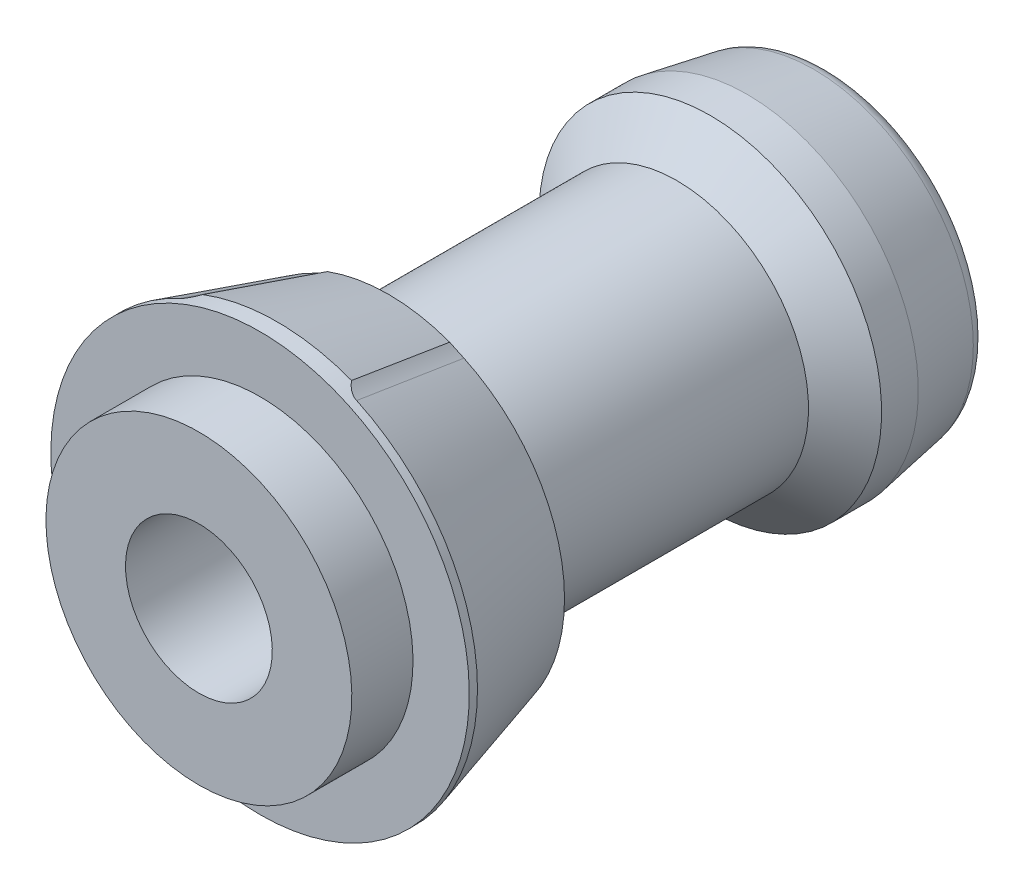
ISO-10303-21;
HEADER;
FILE_DESCRIPTION(('STEP AP214'),'2;1');
FILE_NAME('part.step','',(''),(''),'','','');
FILE_SCHEMA(('AUTOMOTIVE_DESIGN { 1 0 10303 214 1 1 1 1 }'));
ENDSEC;
DATA;
#1=APPLICATION_CONTEXT('core data for automotive mechanical design processes');
#2=APPLICATION_PROTOCOL_DEFINITION('international standard','automotive_design',2000,#1);
#3=PRODUCT_CONTEXT('',#1,'mechanical');
#4=PRODUCT('Part','Part','',(#3));
#5=PRODUCT_RELATED_PRODUCT_CATEGORY('part','',(#4));
#6=PRODUCT_DEFINITION_FORMATION('','',#4);
#7=PRODUCT_DEFINITION_CONTEXT('part definition',#1,'design');
#8=PRODUCT_DEFINITION('design','',#6,#7);
#9=PRODUCT_DEFINITION_SHAPE('','',#8);
#10=(LENGTH_UNIT() NAMED_UNIT(*) SI_UNIT(.MILLI.,.METRE.));
#11=(NAMED_UNIT(*) PLANE_ANGLE_UNIT() SI_UNIT($,.RADIAN.));
#12=(NAMED_UNIT(*) SI_UNIT($,.STERADIAN.) SOLID_ANGLE_UNIT());
#13=UNCERTAINTY_MEASURE_WITH_UNIT(LENGTH_MEASURE(1.E-05),#10,'distance_accuracy_value','');
#14=(GEOMETRIC_REPRESENTATION_CONTEXT(3) GLOBAL_UNCERTAINTY_ASSIGNED_CONTEXT((#13)) GLOBAL_UNIT_ASSIGNED_CONTEXT((#10,
#11,#12)) REPRESENTATION_CONTEXT('',''));
#15=CARTESIAN_POINT('',(0.,0.,0.));
#16=DIRECTION('',(0.,0.,1.));
#17=DIRECTION('',(1.,0.,0.));
#18=AXIS2_PLACEMENT_3D('',#15,#16,#17);
#19=CARTESIAN_POINT('',(0.,1.15218884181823E-13,-33.));
#20=DIRECTION('',(0.,0.,-1.));
#21=DIRECTION('',(0.,1.,0.));
#22=AXIS2_PLACEMENT_3D('',#19,#20,#21);
#23=PLANE('',#22);
#24=CARTESIAN_POINT('',(0.,1.15218884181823E-13,-33.));
#25=DIRECTION('',(0.,0.,-1.));
#26=DIRECTION('',(0.,1.,0.));
#27=AXIS2_PLACEMENT_3D('',#24,#25,#26);
#28=CIRCLE('',#27,5.);
#29=CARTESIAN_POINT('',(0.,5.00000000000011,-33.));
#30=VERTEX_POINT('',#29);
#31=CARTESIAN_POINT('',(4.3301270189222,2.50000000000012,-33.));
#32=VERTEX_POINT('',#31);
#33=EDGE_CURVE('E10',#30,#32,#28,.T.);
#34=ORIENTED_EDGE('',*,*,#33,.F.);
#35=DIRECTION('',(1.,0.,0.));
#36=VECTOR('',#35,1.);
#37=CARTESIAN_POINT('',(-2.88675134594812,5.00000000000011,-33.));
#38=LINE('',#37,#36);
#39=CARTESIAN_POINT('',(2.88675134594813,5.00000000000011,-33.));
#40=VERTEX_POINT('',#39);
#41=EDGE_CURVE('E146',#30,#40,#38,.T.);
#42=ORIENTED_EDGE('',*,*,#41,.T.);
#43=DIRECTION('',(0.5,-0.866025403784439,0.));
#44=VECTOR('',#43,1.);
#45=CARTESIAN_POINT('',(2.88675134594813,5.00000000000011,-33.));
#46=LINE('',#45,#44);
#47=EDGE_CURVE('E149',#40,#32,#46,.T.);
#48=ORIENTED_EDGE('',*,*,#47,.T.);
#49=EDGE_LOOP('',(#34,#42,#48));
#50=FACE_BOUND('',#49,.T.);
#51=ADVANCED_FACE('F16',(#50),#23,.T.);
#52=CARTESIAN_POINT('',(4.33012701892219,-2.49999999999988,-33.));
#53=VERTEX_POINT('',#52);
#54=EDGE_CURVE('E25',#32,#53,#28,.T.);
#55=ORIENTED_EDGE('',*,*,#54,.F.);
#56=CARTESIAN_POINT('',(5.77350269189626,1.16013007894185E-13,-33.));
#57=VERTEX_POINT('',#56);
#58=EDGE_CURVE('E179',#32,#57,#46,.T.);
#59=ORIENTED_EDGE('',*,*,#58,.T.);
#60=DIRECTION('',(-0.5,-0.866025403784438,0.));
#61=VECTOR('',#60,1.);
#62=CARTESIAN_POINT('',(5.77350269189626,1.16013007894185E-13,-33.));
#63=LINE('',#62,#61);
#64=EDGE_CURVE('E462',#57,#53,#63,.T.);
#65=ORIENTED_EDGE('',*,*,#64,.T.);
#66=EDGE_LOOP('',(#55,#59,#65));
#67=FACE_BOUND('',#66,.T.);
#68=ADVANCED_FACE('F416',(#67),#23,.T.);
#69=CARTESIAN_POINT('',(0.,-4.99999999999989,-33.));
#70=VERTEX_POINT('',#69);
#71=EDGE_CURVE('E478',#53,#70,#28,.T.);
#72=ORIENTED_EDGE('',*,*,#71,.F.);
#73=CARTESIAN_POINT('',(2.88675134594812,-4.99999999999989,-33.));
#74=VERTEX_POINT('',#73);
#75=EDGE_CURVE('E465',#53,#74,#63,.T.);
#76=ORIENTED_EDGE('',*,*,#75,.T.);
#77=DIRECTION('',(-1.,0.,0.));
#78=VECTOR('',#77,1.);
#79=CARTESIAN_POINT('',(2.88675134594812,-4.99999999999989,-33.));
#80=LINE('',#79,#78);
#81=EDGE_CURVE('E454',#74,#70,#80,.T.);
#82=ORIENTED_EDGE('',*,*,#81,.T.);
#83=EDGE_LOOP('',(#72,#76,#82));
#84=FACE_BOUND('',#83,.T.);
#85=ADVANCED_FACE('F421',(#84),#23,.T.);
#86=CARTESIAN_POINT('',(-4.3301270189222,-2.49999999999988,-33.));
#87=VERTEX_POINT('',#86);
#88=EDGE_CURVE('E448',#70,#87,#28,.T.);
#89=ORIENTED_EDGE('',*,*,#88,.F.);
#90=CARTESIAN_POINT('',(-2.88675134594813,-4.99999999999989,-33.));
#91=VERTEX_POINT('',#90);
#92=EDGE_CURVE('E457',#70,#91,#80,.T.);
#93=ORIENTED_EDGE('',*,*,#92,.T.);
#94=DIRECTION('',(-0.5,0.866025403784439,0.));
#95=VECTOR('',#94,1.);
#96=CARTESIAN_POINT('',(-2.88675134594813,-4.99999999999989,-33.));
#97=LINE('',#96,#95);
#98=EDGE_CURVE('E453',#91,#87,#97,.T.);
#99=ORIENTED_EDGE('',*,*,#98,.T.);
#100=EDGE_LOOP('',(#89,#93,#99));
#101=FACE_BOUND('',#100,.T.);
#102=ADVANCED_FACE('F435',(#101),#23,.T.);
#103=CARTESIAN_POINT('',(-4.3301270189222,2.50000000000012,-33.));
#104=VERTEX_POINT('',#103);
#105=EDGE_CURVE('E33',#87,#104,#28,.T.);
#106=ORIENTED_EDGE('',*,*,#105,.F.);
#107=CARTESIAN_POINT('',(-5.77350269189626,1.14384011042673E-13,-33.));
#108=VERTEX_POINT('',#107);
#109=EDGE_CURVE('E445',#87,#108,#97,.T.);
#110=ORIENTED_EDGE('',*,*,#109,.T.);
#111=DIRECTION('',(0.5,0.866025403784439,0.));
#112=VECTOR('',#111,1.);
#113=CARTESIAN_POINT('',(-5.77350269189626,1.14384011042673E-13,-33.));
#114=LINE('',#113,#112);
#115=EDGE_CURVE('E156',#108,#104,#114,.T.);
#116=ORIENTED_EDGE('',*,*,#115,.T.);
#117=EDGE_LOOP('',(#106,#110,#116));
#118=FACE_BOUND('',#117,.T.);
#119=ADVANCED_FACE('F427',(#118),#23,.T.);
#120=CARTESIAN_POINT('',(0.,0.,0.));
#121=DIRECTION('',(0.,0.,-1.));
#122=DIRECTION('',(0.,1.,0.));
#123=AXIS2_PLACEMENT_3D('',#120,#121,#122);
#124=CYLINDRICAL_SURFACE('',#123,17.1);
#125=CARTESIAN_POINT('',(0.,0.,0.));
#126=DIRECTION('',(0.,0.,1.));
#127=DIRECTION('',(0.,-1.,0.));
#128=AXIS2_PLACEMENT_3D('',#125,#126,#127);
#129=CIRCLE('',#128,17.1);
#130=CARTESIAN_POINT('',(0.,-17.1,0.));
#131=VERTEX_POINT('',#130);
#132=EDGE_CURVE('E370',#131,#131,#129,.F.);
#133=ORIENTED_EDGE('',*,*,#132,.T.);
#134=EDGE_LOOP('',(#133));
#135=FACE_BOUND('',#134,.T.);
#136=CARTESIAN_POINT('',(0.,0.,-1.3949657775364));
#137=DIRECTION('',(0.,0.,-1.));
#138=DIRECTION('',(0.,1.,0.));
#139=AXIS2_PLACEMENT_3D('',#136,#137,#138);
#140=CIRCLE('',#139,17.1);
#141=CARTESIAN_POINT('',(-6.08241428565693,15.9816844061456,-1.39496577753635));
#142=VERTEX_POINT('',#141);
#143=CARTESIAN_POINT('',(6.08241428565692,15.9816844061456,-1.39496577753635));
#144=VERTEX_POINT('',#143);
#145=EDGE_CURVE('E351',#142,#144,#140,.T.);
#146=ORIENTED_EDGE('',*,*,#145,.F.);
#147=CARTESIAN_POINT('',(-6.08241428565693,15.9816844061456,-1.39496577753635));
#148=CARTESIAN_POINT('',(-6.11358364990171,15.9698208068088,-1.35559954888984));
#149=CARTESIAN_POINT('',(-6.14546425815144,15.9575841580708,-1.31691915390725));
#150=CARTESIAN_POINT('',(-6.21088953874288,15.9322342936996,-1.24117287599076));
#151=CARTESIAN_POINT('',(-6.24443696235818,15.919119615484,-1.20410986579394));
#152=CARTESIAN_POINT('',(-6.3489458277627,15.8778644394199,-1.09469106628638));
#153=CARTESIAN_POINT('',(-6.42273072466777,15.8482070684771,-1.02546248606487));
#154=CARTESIAN_POINT('',(-6.56178746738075,15.7910507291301,-0.913713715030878));
#155=CARTESIAN_POINT('',(-6.62538961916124,15.7644993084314,-0.86866394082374));
#156=CARTESIAN_POINT('',(-6.75771078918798,15.7082289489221,-0.790024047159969));
#157=CARTESIAN_POINT('',(-6.82639671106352,15.6785300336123,-0.756366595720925));
#158=CARTESIAN_POINT('',(-6.95174579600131,15.6232767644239,-0.710210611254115));
#159=CARTESIAN_POINT('',(-7.00753100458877,15.5983449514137,-0.694623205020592));
#160=CARTESIAN_POINT('',(-7.12045520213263,15.5471203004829,-0.673973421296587));
#161=CARTESIAN_POINT('',(-7.17759380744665,15.5208278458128,-0.668908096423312));
#162=CARTESIAN_POINT('',(-7.29156400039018,15.4676131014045,-0.669910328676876));
#163=CARTESIAN_POINT('',(-7.34839510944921,15.4406900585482,-0.675991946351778));
#164=CARTESIAN_POINT('',(-7.46001209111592,15.3870746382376,-0.698586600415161));
#165=CARTESIAN_POINT('',(-7.51479716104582,15.3603823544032,-0.715103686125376));
#166=CARTESIAN_POINT('',(-7.63943667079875,15.2988676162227,-0.764103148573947));
#167=CARTESIAN_POINT('',(-7.70805310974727,15.2643793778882,-0.800110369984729));
#168=CARTESIAN_POINT('',(-7.83923225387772,15.1974314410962,-0.883793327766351));
#169=CARTESIAN_POINT('',(-7.9017560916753,15.1649851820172,-0.93153790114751));
#170=CARTESIAN_POINT('',(-8.03102725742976,15.096980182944,-1.04391100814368));
#171=CARTESIAN_POINT('',(-8.096676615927,15.0618342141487,-1.11003032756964));
#172=CARTESIAN_POINT('',(-8.18946646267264,15.01145709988,-1.21408001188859));
#173=CARTESIAN_POINT('',(-8.2192291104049,14.9951783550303,-1.24926927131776));
#174=CARTESIAN_POINT('',(-8.27720907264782,14.9632516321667,-1.32109105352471));
#175=CARTESIAN_POINT('',(-8.30542837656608,14.9476028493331,-1.35772160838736));
#176=CARTESIAN_POINT('',(-8.33297999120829,14.932228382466,-1.39496577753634));
#177=B_SPLINE_CURVE_WITH_KNOTS('',3,(#147,#148,#149,#150,#151,#152,#153,#154,#155,#156,#157,
#158,#159,#160,#161,#162,#163,#164,#165,#166,#167,#168,#169,#170,#171,#172,#173,#174,#175,#176),
.UNSPECIFIED.,.F.,.F.,(4,2,2,2,2,2,2,2,2,2,2,2,2,2,4),(0.,0.154747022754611,0.309758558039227,
0.625028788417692,0.871317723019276,1.11612450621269,1.30450457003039,1.49283185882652,
1.68139686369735,1.87003508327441,2.12305130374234,2.37758837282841,2.67553132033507,
2.82213393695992,2.96854289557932),.UNSPECIFIED.);
#178=CARTESIAN_POINT('',(-7.22677227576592,15.4978631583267,-0.669374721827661));
#179=VERTEX_POINT('',#178);
#180=EDGE_CURVE('E199',#142,#179,#177,.T.);
#181=ORIENTED_EDGE('',*,*,#180,.T.);
#182=CARTESIAN_POINT('',(0.,0.,-0.669374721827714));
#183=DIRECTION('',(0.,0.,1.));
#184=DIRECTION('',(0.,-1.,0.));
#185=AXIS2_PLACEMENT_3D('',#182,#183,#184);
#186=CIRCLE('',#185,17.1);
#187=CARTESIAN_POINT('',(-7.22677227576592,-15.4978631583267,-0.669374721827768));
#188=VERTEX_POINT('',#187);
#189=EDGE_CURVE('E283',#188,#179,#186,.F.);
#190=ORIENTED_EDGE('',*,*,#189,.F.);
#191=CARTESIAN_POINT('',(-8.33297999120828,-14.932228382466,-1.39496577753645));
#192=CARTESIAN_POINT('',(-8.30385666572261,-14.9484797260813,-1.35559954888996));
#193=CARTESIAN_POINT('',(-8.27399038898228,-14.9650361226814,-1.31691915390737));
#194=CARTESIAN_POINT('',(-8.21251670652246,-14.9988602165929,-1.24117287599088));
#195=CARTESIAN_POINT('',(-8.18090641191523,-15.0161290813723,-1.20410986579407));
#196=CARTESIAN_POINT('',(-8.08212610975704,-15.0696692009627,-1.09469106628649));
#197=CARTESIAN_POINT('',(-8.01197922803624,-15.107128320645,-1.02546248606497));
#198=CARTESIAN_POINT('',(-7.87881098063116,-15.1769125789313,-0.913713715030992));
#199=CARTESIAN_POINT('',(-7.8175887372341,-15.2085677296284,-0.868663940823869));
#200=CARTESIAN_POINT('',(-7.68942873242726,-15.2737617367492,-0.790024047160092));
#201=CARTESIAN_POINT('',(-7.62252758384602,-15.3072881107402,-0.756366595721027));
#202=CARTESIAN_POINT('',(-7.49962828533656,-15.3677949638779,-0.71021061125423));
#203=CARTESIAN_POINT('',(-7.4446713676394,-15.3945030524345,-0.694623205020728));
#204=CARTESIAN_POINT('',(-7.33284473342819,-15.4480814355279,-0.67397342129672));
#205=CARTESIAN_POINT('',(-7.27597555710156,-15.474951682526,-0.66890809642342));
#206=CARTESIAN_POINT('',(-7.16195206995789,-15.5280521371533,-0.669910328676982));
#207=CARTESIAN_POINT('',(-7.10479748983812,-15.5542814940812,-0.675991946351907));
#208=CARTESIAN_POINT('',(-6.99197968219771,-15.6053217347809,-0.698586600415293));
#209=CARTESIAN_POINT('',(-6.93631704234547,-15.6301320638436,-0.715103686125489));
#210=CARTESIAN_POINT('',(-6.80907728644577,-15.6860705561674,-0.764103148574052));
#211=CARTESIAN_POINT('',(-6.73855196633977,-15.7164651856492,-0.80011036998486));
#212=CARTESIAN_POINT('',(-6.60294654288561,-15.7739209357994,-0.88379332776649));
#213=CARTESIAN_POINT('',(-6.53790171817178,-15.80096092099,-0.931537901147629));
#214=CARTESIAN_POINT('',(-6.40271296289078,-15.8562756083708,-1.04391100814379));
#215=CARTESIAN_POINT('',(-6.33359099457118,-15.8839745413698,-1.11003032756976));
#216=CARTESIAN_POINT('',(-6.23535572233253,-15.9226739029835,-1.21408001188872));
#217=CARTESIAN_POINT('',(-6.20375441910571,-15.9350096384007,-1.24926927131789));
#218=CARTESIAN_POINT('',(-6.14202832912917,-15.9589027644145,-1.32109105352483));
#219=CARTESIAN_POINT('',(-6.11190164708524,-15.9704611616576,-1.35772160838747));
#220=CARTESIAN_POINT('',(-6.08241428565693,-15.9816844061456,-1.39496577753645));
#221=B_SPLINE_CURVE_WITH_KNOTS('',3,(#191,#192,#193,#194,#195,#196,#197,#198,#199,#200,#201,
#202,#203,#204,#205,#206,#207,#208,#209,#210,#211,#212,#213,#214,#215,#216,#217,#218,#219,#220),
.UNSPECIFIED.,.F.,.F.,(4,2,2,2,2,2,2,2,2,2,2,2,2,2,4),(0.,0.154747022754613,0.309758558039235,
0.625028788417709,0.871317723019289,1.1161245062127,1.30450457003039,1.49283185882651,
1.68139686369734,1.8700350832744,2.12305130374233,2.37758837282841,2.67553132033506,
2.82213393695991,2.9685428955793),.UNSPECIFIED.);
#222=CARTESIAN_POINT('',(-6.08241428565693,-15.9816844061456,-1.39496577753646));
#223=VERTEX_POINT('',#222);
#224=EDGE_CURVE('E269',#188,#223,#221,.T.);
#225=ORIENTED_EDGE('',*,*,#224,.T.);
#226=CARTESIAN_POINT('',(6.08241428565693,-15.9816844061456,-1.39496577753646));
#227=VERTEX_POINT('',#226);
#228=EDGE_CURVE('E352',#227,#223,#140,.T.);
#229=ORIENTED_EDGE('',*,*,#228,.F.);
#230=CARTESIAN_POINT('',(6.08241428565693,-15.9816844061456,-1.39496577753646));
#231=CARTESIAN_POINT('',(6.11358364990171,-15.9698208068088,-1.35559954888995));
#232=CARTESIAN_POINT('',(6.14546425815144,-15.9575841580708,-1.31691915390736));
#233=CARTESIAN_POINT('',(6.21088953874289,-15.9322342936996,-1.24117287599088));
#234=CARTESIAN_POINT('',(6.24443696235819,-15.9191196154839,-1.20410986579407));
#235=CARTESIAN_POINT('',(6.34894582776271,-15.8778644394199,-1.0946910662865));
#236=CARTESIAN_POINT('',(6.42273072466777,-15.8482070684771,-1.02546248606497));
#237=CARTESIAN_POINT('',(6.56178746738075,-15.7910507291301,-0.913713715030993));
#238=CARTESIAN_POINT('',(6.62538961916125,-15.7644993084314,-0.868663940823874));
#239=CARTESIAN_POINT('',(6.75771078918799,-15.7082289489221,-0.790024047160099));
#240=CARTESIAN_POINT('',(6.82639671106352,-15.6785300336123,-0.756366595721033));
#241=CARTESIAN_POINT('',(6.95174579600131,-15.6232767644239,-0.710210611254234));
#242=CARTESIAN_POINT('',(7.00753100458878,-15.5983449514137,-0.694623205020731));
#243=CARTESIAN_POINT('',(7.12045520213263,-15.5471203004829,-0.673973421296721));
#244=CARTESIAN_POINT('',(7.17759380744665,-15.5208278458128,-0.668908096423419));
#245=CARTESIAN_POINT('',(7.29156400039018,-15.4676131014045,-0.669910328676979));
#246=CARTESIAN_POINT('',(7.34839510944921,-15.4406900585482,-0.675991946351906));
#247=CARTESIAN_POINT('',(7.46001209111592,-15.3870746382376,-0.698586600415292));
#248=CARTESIAN_POINT('',(7.51479716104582,-15.3603823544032,-0.715103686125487));
#249=CARTESIAN_POINT('',(7.63943667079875,-15.2988676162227,-0.76410314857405));
#250=CARTESIAN_POINT('',(7.70805310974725,-15.2643793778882,-0.800110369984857));
#251=CARTESIAN_POINT('',(7.8392322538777,-15.1974314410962,-0.883793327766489));
#252=CARTESIAN_POINT('',(7.90175609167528,-15.1649851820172,-0.931537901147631));
#253=CARTESIAN_POINT('',(8.03102725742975,-15.096980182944,-1.04391100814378));
#254=CARTESIAN_POINT('',(8.096676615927,-15.0618342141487,-1.11003032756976));
#255=CARTESIAN_POINT('',(8.18946646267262,-15.01145709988,-1.21408001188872));
#256=CARTESIAN_POINT('',(8.21922911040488,-14.9951783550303,-1.24926927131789));
#257=CARTESIAN_POINT('',(8.2772090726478,-14.9632516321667,-1.32109105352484));
#258=CARTESIAN_POINT('',(8.30542837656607,-14.947602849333,-1.35772160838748));
#259=CARTESIAN_POINT('',(8.33297999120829,-14.932228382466,-1.39496577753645));
#260=B_SPLINE_CURVE_WITH_KNOTS('',3,(#230,#231,#232,#233,#234,#235,#236,#237,#238,#239,#240,
#241,#242,#243,#244,#245,#246,#247,#248,#249,#250,#251,#252,#253,#254,#255,#256,#257,#258,#259),
.UNSPECIFIED.,.F.,.F.,(4,2,2,2,2,2,2,2,2,2,2,2,2,2,4),(0.,0.154747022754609,0.309758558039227,
0.625028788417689,0.87131772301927,1.11612450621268,1.30450457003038,1.49283185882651,
1.68139686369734,1.8700350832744,2.12305130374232,2.37758837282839,2.67553132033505,
2.8221339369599,2.9685428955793),.UNSPECIFIED.);
#261=CARTESIAN_POINT('',(7.22677227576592,-15.4978631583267,-0.669374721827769));
#262=VERTEX_POINT('',#261);
#263=EDGE_CURVE('E300',#227,#262,#260,.T.);
#264=ORIENTED_EDGE('',*,*,#263,.T.);
#265=CARTESIAN_POINT('',(0.,0.,-0.669374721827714));
#266=DIRECTION('',(0.,0.,1.));
#267=DIRECTION('',(0.,-1.,0.));
#268=AXIS2_PLACEMENT_3D('',#265,#266,#267);
#269=CIRCLE('',#268,17.1);
#270=CARTESIAN_POINT('',(7.22677227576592,15.4978631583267,-0.66937472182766));
#271=VERTEX_POINT('',#270);
#272=EDGE_CURVE('E326',#271,#262,#269,.F.);
#273=ORIENTED_EDGE('',*,*,#272,.F.);
#274=CARTESIAN_POINT('',(8.33297999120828,14.932228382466,-1.39496577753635));
#275=CARTESIAN_POINT('',(8.30385666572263,14.9484797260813,-1.35559954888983));
#276=CARTESIAN_POINT('',(8.27399038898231,14.9650361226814,-1.31691915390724));
#277=CARTESIAN_POINT('',(8.21251670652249,14.9988602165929,-1.24117287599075));
#278=CARTESIAN_POINT('',(8.18090641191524,15.0161290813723,-1.20410986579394));
#279=CARTESIAN_POINT('',(8.08212610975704,15.0696692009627,-1.09469106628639));
#280=CARTESIAN_POINT('',(8.01197922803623,15.107128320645,-1.02546248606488));
#281=CARTESIAN_POINT('',(7.87881098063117,15.1769125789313,-0.913713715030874));
#282=CARTESIAN_POINT('',(7.81758873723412,15.2085677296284,-0.868663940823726));
#283=CARTESIAN_POINT('',(7.68942873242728,15.2737617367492,-0.790024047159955));
#284=CARTESIAN_POINT('',(7.62252758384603,15.3072881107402,-0.756366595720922));
#285=CARTESIAN_POINT('',(7.49962828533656,15.3677949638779,-0.71021061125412));
#286=CARTESIAN_POINT('',(7.4446713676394,15.3945030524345,-0.694623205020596));
#287=CARTESIAN_POINT('',(7.3328447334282,15.4480814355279,-0.673973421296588));
#288=CARTESIAN_POINT('',(7.27597555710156,15.474951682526,-0.668908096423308));
#289=CARTESIAN_POINT('',(7.16195206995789,15.5280521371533,-0.66991032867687));
#290=CARTESIAN_POINT('',(7.10479748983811,15.5542814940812,-0.675991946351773));
#291=CARTESIAN_POINT('',(6.99197968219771,15.6053217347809,-0.698586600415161));
#292=CARTESIAN_POINT('',(6.93631704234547,15.6301320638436,-0.715103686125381));
#293=CARTESIAN_POINT('',(6.80907728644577,15.6860705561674,-0.764103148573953));
#294=CARTESIAN_POINT('',(6.73855196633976,15.7164651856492,-0.800110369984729));
#295=CARTESIAN_POINT('',(6.6029465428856,15.7739209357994,-0.883793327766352));
#296=CARTESIAN_POINT('',(6.53790171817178,15.80096092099,-0.931537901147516));
#297=CARTESIAN_POINT('',(6.40271296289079,15.8562756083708,-1.04391100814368));
#298=CARTESIAN_POINT('',(6.33359099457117,15.8839745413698,-1.11003032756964));
#299=CARTESIAN_POINT('',(6.23535572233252,15.9226739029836,-1.21408001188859));
#300=CARTESIAN_POINT('',(6.2037544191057,15.9350096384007,-1.24926927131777));
#301=CARTESIAN_POINT('',(6.14202832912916,15.9589027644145,-1.32109105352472));
#302=CARTESIAN_POINT('',(6.11190164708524,15.9704611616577,-1.35772160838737));
#303=CARTESIAN_POINT('',(6.08241428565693,15.9816844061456,-1.39496577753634));
#304=B_SPLINE_CURVE_WITH_KNOTS('',3,(#274,#275,#276,#277,#278,#279,#280,#281,#282,#283,#284,
#285,#286,#287,#288,#289,#290,#291,#292,#293,#294,#295,#296,#297,#298,#299,#300,#301,#302,#303),
.UNSPECIFIED.,.F.,.F.,(4,2,2,2,2,2,2,2,2,2,2,2,2,2,4),(0.,0.154747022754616,0.309758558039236,
0.625028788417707,0.871317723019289,1.11612450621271,1.3045045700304,1.49283185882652,
1.68139686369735,1.87003508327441,2.12305130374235,2.37758837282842,2.67553132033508,
2.82213393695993,2.96854289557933),.UNSPECIFIED.);
#305=EDGE_CURVE('E318',#271,#144,#304,.T.);
#306=ORIENTED_EDGE('',*,*,#305,.T.);
#307=EDGE_LOOP('',(#146,#181,#190,#225,#229,#264,#273,#306));
#308=FACE_BOUND('',#307,.T.);
#309=ADVANCED_FACE('F238',(#135,#308),#124,.T.);
#310=CARTESIAN_POINT('',(0.,0.,-12.6588127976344));
#311=DIRECTION('',(0.,0.,1.));
#312=DIRECTION('',(0.,-1.,0.));
#313=AXIS2_PLACEMENT_3D('',#310,#311,#312);
#314=CONICAL_SURFACE('',#313,10.75,1.0471975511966);
#315=CARTESIAN_POINT('',(0.,0.,-12.6588127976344));
#316=DIRECTION('',(0.,0.,1.));
#317=DIRECTION('',(0.,-1.,0.));
#318=AXIS2_PLACEMENT_3D('',#315,#316,#317);
#319=CIRCLE('',#318,10.75);
#320=CARTESIAN_POINT('',(0.,-10.75,-12.6588127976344));
#321=VERTEX_POINT('',#320);
#322=EDGE_CURVE('E360',#321,#321,#319,.T.);
#323=ORIENTED_EDGE('',*,*,#322,.T.);
#324=EDGE_LOOP('',(#323));
#325=FACE_BOUND('',#324,.T.);
#326=CARTESIAN_POINT('',(-3.99844389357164,15.0041069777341,-9.90038201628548));
#327=CARTESIAN_POINT('',(-4.04739117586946,14.8991954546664,-9.95162523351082));
#328=CARTESIAN_POINT('',(-4.10004476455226,14.7953754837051,-10.0014157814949));
#329=CARTESIAN_POINT('',(-4.21352119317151,14.5902349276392,-10.0975505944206));
#330=CARTESIAN_POINT('',(-4.27436556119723,14.4889217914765,-10.1438852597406));
#331=CARTESIAN_POINT('',(-4.46887448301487,14.1916322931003,-10.275787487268));
#332=CARTESIAN_POINT('',(-4.61527124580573,14.0006265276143,-10.3550854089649));
#333=CARTESIAN_POINT('',(-4.81387737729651,13.7836062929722,-10.4360304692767));
#334=CARTESIAN_POINT('',(-4.84936155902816,13.7462230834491,-10.4496127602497));
#335=CARTESIAN_POINT('',(-4.92194725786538,13.6725577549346,-10.4756078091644));
#336=CARTESIAN_POINT('',(-4.95905044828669,13.6362768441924,-10.4880193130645));
#337=CARTESIAN_POINT('',(-5.12583118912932,13.4793604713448,-10.5398475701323));
#338=CARTESIAN_POINT('',(-5.2640219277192,13.3652005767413,-10.5726053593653));
#339=CARTESIAN_POINT('',(-5.55708358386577,13.1558525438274,-10.6205927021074));
#340=CARTESIAN_POINT('',(-5.71196846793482,13.0606804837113,-10.6358074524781));
#341=CARTESIAN_POINT('',(-6.03482989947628,12.8930827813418,-10.6471023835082));
#342=CARTESIAN_POINT('',(-6.20284173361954,12.8207212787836,-10.6431291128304));
#343=CARTESIAN_POINT('',(-6.54595567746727,12.7011812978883,-10.6163469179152));
#344=CARTESIAN_POINT('',(-6.72104913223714,12.6539730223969,-10.5935603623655));
#345=CARTESIAN_POINT('',(-6.94841778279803,12.6088661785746,-10.5534599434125));
#346=CARTESIAN_POINT('',(-7.00006673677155,12.5996940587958,-10.5436535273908));
#347=CARTESIAN_POINT('',(-7.10337888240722,12.5834132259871,-10.5227089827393));
#348=CARTESIAN_POINT('',(-7.15504202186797,12.5763027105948,-10.5115720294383));
#349=CARTESIAN_POINT('',(-7.34009149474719,12.5544243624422,-10.4693917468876));
#350=CARTESIAN_POINT('',(-7.47337589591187,12.5453545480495,-10.4347460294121));
#351=CARTESIAN_POINT('',(-7.73823297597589,12.5395442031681,-10.3583269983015));
#352=CARTESIAN_POINT('',(-7.86980337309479,12.5428186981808,-10.3165450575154));
#353=CARTESIAN_POINT('',(-8.13088324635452,12.5605523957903,-10.226895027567));
#354=CARTESIAN_POINT('',(-8.26037699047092,12.5750743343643,-10.1789940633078));
#355=CARTESIAN_POINT('',(-8.51586981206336,12.6141793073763,-10.0784356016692));
#356=CARTESIAN_POINT('',(-8.64186964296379,12.6387601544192,-10.025779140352));
#357=CARTESIAN_POINT('',(-8.93036466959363,12.7063486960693,-9.89891218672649));
#358=CARTESIAN_POINT('',(-9.09142878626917,12.7527478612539,-9.82325382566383));
#359=CARTESIAN_POINT('',(-9.40647790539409,12.8592008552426,-9.66693044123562));
#360=CARTESIAN_POINT('',(-9.56045920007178,12.9192617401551,-9.58626284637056));
#361=CARTESIAN_POINT('',(-9.86097382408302,13.0512573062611,-9.42132469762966));
#362=CARTESIAN_POINT('',(-10.0075140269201,13.1231807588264,-9.33705760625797));
#363=CARTESIAN_POINT('',(-10.293194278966,13.2775492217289,-9.16586445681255));
#364=CARTESIAN_POINT('',(-10.4323373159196,13.359989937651,-9.0789394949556));
#365=CARTESIAN_POINT('',(-10.6595860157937,13.5062098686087,-8.93149353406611));
#366=CARTESIAN_POINT('',(-10.7496875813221,13.5674402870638,-8.87149179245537));
#367=CARTESIAN_POINT('',(-10.9262179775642,13.6937555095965,-8.75097655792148));
#368=CARTESIAN_POINT('',(-11.012657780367,13.7588271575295,-8.69046535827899));
#369=CARTESIAN_POINT('',(-11.0974181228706,13.8257816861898,-8.62968901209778));
#370=B_SPLINE_CURVE_WITH_KNOTS('',3,(#326,#327,#328,#329,#330,#331,#332,#333,#334,#335,#336,
#337,#338,#339,#340,#341,#342,#343,#344,#345,#346,#347,#348,#349,#350,#351,#352,#353,#354,#355,
#356,#357,#358,#359,#360,#361,#362,#363,#364,#365,#366,#367,#368,#369),.UNSPECIFIED.,.F.,.F.,(4,
2,2,2,2,2,2,2,2,2,2,2,2,2,2,2,2,2,2,2,2,4),(0.,0.379581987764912,0.760181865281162,
1.51537254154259,1.67524812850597,1.83529306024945,2.37935391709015,2.92387352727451,
3.46991085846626,4.01529989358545,4.17536806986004,4.33529588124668,4.74840437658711,
5.16201587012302,5.57795116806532,5.99379606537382,6.54463781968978,7.09576472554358,
7.64637291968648,8.19675700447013,8.56975740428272,8.94154707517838),.UNSPECIFIED.);
#371=CARTESIAN_POINT('',(-4.99760386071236,13.6000037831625,-10.5));
#372=VERTEX_POINT('',#371);
#373=CARTESIAN_POINT('',(-6.01801429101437,12.9056732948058,-10.6439556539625));
#374=VERTEX_POINT('',#373);
#375=EDGE_CURVE('E181',#372,#374,#370,.T.);
#376=ORIENTED_EDGE('',*,*,#375,.F.);
#377=CARTESIAN_POINT('',(0.,0.,-10.5));
#378=DIRECTION('',(0.,0.,-1.));
#379=DIRECTION('',(0.,1.,0.));
#380=AXIS2_PLACEMENT_3D('',#377,#378,#379);
#381=CIRCLE('',#380,14.4891734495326);
#382=CARTESIAN_POINT('',(4.99760386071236,13.6000037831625,-10.5));
#383=VERTEX_POINT('',#382);
#384=EDGE_CURVE('E347',#372,#383,#381,.T.);
#385=ORIENTED_EDGE('',*,*,#384,.T.);
#386=CARTESIAN_POINT('',(11.1664519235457,13.8810373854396,-8.57985546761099));
#387=CARTESIAN_POINT('',(11.0241014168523,13.7656652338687,-8.6832498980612));
#388=CARTESIAN_POINT('',(10.8768921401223,13.6555446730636,-8.78600856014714));
#389=CARTESIAN_POINT('',(10.5723570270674,13.4469939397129,-8.98954916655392));
#390=CARTESIAN_POINT('',(10.4150041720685,13.3485971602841,-9.09032481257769));
#391=CARTESIAN_POINT('',(10.0878392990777,13.1637944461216,-9.29027989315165));
#392=CARTESIAN_POINT('',(9.91786189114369,13.0776187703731,-9.38940372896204));
#393=CARTESIAN_POINT('',(9.56814720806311,12.9214965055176,-9.58262312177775));
#394=CARTESIAN_POINT('',(9.38842254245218,12.8515295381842,-9.67672487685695));
#395=CARTESIAN_POINT('',(8.99049891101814,12.720932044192,-9.87211644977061));
#396=CARTESIAN_POINT('',(8.77066660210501,12.6634516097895,-9.97224402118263));
#397=CARTESIAN_POINT('',(8.32051024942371,12.5793594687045,-10.158148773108));
#398=CARTESIAN_POINT('',(8.09026228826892,12.5525527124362,-10.2440136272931));
#399=CARTESIAN_POINT('',(7.7492406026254,12.5403968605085,-10.3544629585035));
#400=CARTESIAN_POINT('',(7.64147903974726,12.5404403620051,-10.3870059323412));
#401=CARTESIAN_POINT('',(7.42476804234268,12.5488801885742,-10.4472424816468));
#402=CARTESIAN_POINT('',(7.31581725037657,12.5572873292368,-10.474929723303));
#403=CARTESIAN_POINT('',(7.03084417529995,12.5909978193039,-10.5398738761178));
#404=CARTESIAN_POINT('',(6.85453572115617,12.6234882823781,-10.5726339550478));
#405=CARTESIAN_POINT('',(6.50582201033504,12.7134347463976,-10.6206019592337));
#406=CARTESIAN_POINT('',(6.33341697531,12.7708921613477,-10.6358088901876));
#407=CARTESIAN_POINT('',(5.9975681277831,12.9104575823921,-10.6471027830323));
#408=CARTESIAN_POINT('',(5.83415389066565,12.9926417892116,-10.6431300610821));
#409=CARTESIAN_POINT('',(5.52203095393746,13.1786412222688,-10.6163495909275));
#410=CARTESIAN_POINT('',(5.3733069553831,13.2824335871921,-10.5935616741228));
#411=CARTESIAN_POINT('',(5.19259440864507,13.4276200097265,-10.5534599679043));
#412=CARTESIAN_POINT('',(5.1523685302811,13.4612896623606,-10.5436536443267));
#413=CARTESIAN_POINT('',(5.07348722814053,13.5299689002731,-10.5227079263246));
#414=CARTESIAN_POINT('',(5.03483039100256,13.5649772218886,-10.5115697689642));
#415=CARTESIAN_POINT('',(4.93078953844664,13.6628692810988,-10.4792347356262));
#416=CARTESIAN_POINT('',(4.86702035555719,13.7270337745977,-10.4567411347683));
#417=CARTESIAN_POINT('',(4.64149255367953,13.9689539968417,-10.3676859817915));
#418=CARTESIAN_POINT('',(4.49454859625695,14.1569232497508,-10.2904285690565));
#419=CARTESIAN_POINT('',(4.29909270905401,14.4494399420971,-10.1616853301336));
#420=CARTESIAN_POINT('',(4.23800495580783,14.5489129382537,-10.1165260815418));
#421=CARTESIAN_POINT('',(4.12387100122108,14.7504179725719,-10.0227331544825));
#422=CARTESIAN_POINT('',(4.07080482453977,14.8524428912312,-9.97410856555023));
#423=CARTESIAN_POINT('',(4.02138112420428,14.9555680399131,-9.92402848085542));
#424=B_SPLINE_CURVE_WITH_KNOTS('',3,(#386,#387,#388,#389,#390,#391,#392,#393,#394,#395,#396,
#397,#398,#399,#400,#401,#402,#403,#404,#405,#406,#407,#408,#409,#410,#411,#412,#413,#414,#415,
#416,#417,#418,#419,#420,#421,#422,#423),.UNSPECIFIED.,.F.,.F.,(4,2,2,2,2,2,2,2,2,2,2,2,2,2,2,2,
2,2,4),(0.,0.631193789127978,1.26414449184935,1.9077718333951,2.55058553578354,3.2934901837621,
4.03164408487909,4.36899007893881,4.70677288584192,5.25104774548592,5.79535343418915,
6.34135400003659,6.88677980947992,7.04685157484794,7.20677579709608,7.48621067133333,
8.23378244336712,8.60905353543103,8.98337416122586),.UNSPECIFIED.);
#425=CARTESIAN_POINT('',(6.01801429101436,12.9056732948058,-10.6439556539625));
#426=VERTEX_POINT('',#425);
#427=EDGE_CURVE('E308',#426,#383,#424,.T.);
#428=ORIENTED_EDGE('',*,*,#427,.F.);
#429=CARTESIAN_POINT('',(0.,0.,-10.6439556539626));
#430=DIRECTION('',(0.,0.,-1.));
#431=DIRECTION('',(0.,1.,0.));
#432=AXIS2_PLACEMENT_3D('',#429,#430,#431);
#433=CIRCLE('',#432,14.2398349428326);
#434=CARTESIAN_POINT('',(6.01801429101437,-12.9056732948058,-10.6439556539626));
#435=VERTEX_POINT('',#434);
#436=EDGE_CURVE('E367',#426,#435,#433,.T.);
#437=ORIENTED_EDGE('',*,*,#436,.T.);
#438=CARTESIAN_POINT('',(3.99844389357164,-15.004106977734,-9.90038201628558));
#439=CARTESIAN_POINT('',(4.04739117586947,-14.8991954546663,-9.95162523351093));
#440=CARTESIAN_POINT('',(4.10004476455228,-14.795375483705,-10.001415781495));
#441=CARTESIAN_POINT('',(4.21352119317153,-14.5902349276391,-10.0975505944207));
#442=CARTESIAN_POINT('',(4.27436556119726,-14.4889217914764,-10.1438852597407));
#443=CARTESIAN_POINT('',(4.46887448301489,-14.1916322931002,-10.2757874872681));
#444=CARTESIAN_POINT('',(4.61527124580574,-14.0006265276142,-10.355085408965));
#445=CARTESIAN_POINT('',(4.81387737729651,-13.7836062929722,-10.4360304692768));
#446=CARTESIAN_POINT('',(4.84936155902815,-13.746223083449,-10.4496127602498));
#447=CARTESIAN_POINT('',(4.92194725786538,-13.6725577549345,-10.4756078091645));
#448=CARTESIAN_POINT('',(4.95905044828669,-13.6362768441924,-10.4880193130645));
#449=CARTESIAN_POINT('',(5.12583118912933,-13.4793604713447,-10.5398475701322));
#450=CARTESIAN_POINT('',(5.26402192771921,-13.3652005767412,-10.5726053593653));
#451=CARTESIAN_POINT('',(5.55708358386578,-13.1558525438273,-10.6205927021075));
#452=CARTESIAN_POINT('',(5.71196846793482,-13.0606804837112,-10.6358074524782));
#453=CARTESIAN_POINT('',(6.03482989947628,-12.8930827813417,-10.6471023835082));
#454=CARTESIAN_POINT('',(6.20284173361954,-12.8207212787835,-10.6431291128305));
#455=CARTESIAN_POINT('',(6.54595567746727,-12.7011812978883,-10.6163469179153));
#456=CARTESIAN_POINT('',(6.72104913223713,-12.6539730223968,-10.5935603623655));
#457=CARTESIAN_POINT('',(6.94841778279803,-12.6088661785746,-10.5534599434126));
#458=CARTESIAN_POINT('',(7.00006673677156,-12.5996940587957,-10.5436535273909));
#459=CARTESIAN_POINT('',(7.10337888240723,-12.5834132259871,-10.5227089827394));
#460=CARTESIAN_POINT('',(7.15504202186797,-12.5763027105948,-10.5115720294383));
#461=CARTESIAN_POINT('',(7.34009149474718,-12.5544243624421,-10.4693917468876));
#462=CARTESIAN_POINT('',(7.47337589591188,-12.5453545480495,-10.4347460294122));
#463=CARTESIAN_POINT('',(7.73823297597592,-12.539544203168,-10.3583269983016));
#464=CARTESIAN_POINT('',(7.86980337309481,-12.5428186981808,-10.3165450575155));
#465=CARTESIAN_POINT('',(8.13088324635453,-12.5605523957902,-10.2268950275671));
#466=CARTESIAN_POINT('',(8.26037699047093,-12.5750743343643,-10.1789940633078));
#467=CARTESIAN_POINT('',(8.51586981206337,-12.6141793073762,-10.0784356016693));
#468=CARTESIAN_POINT('',(8.6418696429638,-12.6387601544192,-10.025779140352));
#469=CARTESIAN_POINT('',(8.93036466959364,-12.7063486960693,-9.89891218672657));
#470=CARTESIAN_POINT('',(9.09142878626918,-12.7527478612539,-9.82325382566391));
#471=CARTESIAN_POINT('',(9.40647790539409,-12.8592008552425,-9.6669304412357));
#472=CARTESIAN_POINT('',(9.56045920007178,-12.9192617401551,-9.58626284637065));
#473=CARTESIAN_POINT('',(9.86097382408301,-13.0512573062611,-9.42132469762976));
#474=CARTESIAN_POINT('',(10.00751402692,-13.1231807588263,-9.33705760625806));
#475=CARTESIAN_POINT('',(10.293194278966,-13.2775492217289,-9.16586445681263));
#476=CARTESIAN_POINT('',(10.4323373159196,-13.3599899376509,-9.07893949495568));
#477=CARTESIAN_POINT('',(10.6595860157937,-13.5062098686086,-8.9314935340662));
#478=CARTESIAN_POINT('',(10.7496875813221,-13.5674402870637,-8.87149179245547));
#479=CARTESIAN_POINT('',(10.9262179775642,-13.6937555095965,-8.75097655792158));
#480=CARTESIAN_POINT('',(11.012657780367,-13.7588271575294,-8.69046535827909));
#481=CARTESIAN_POINT('',(11.0974181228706,-13.8257816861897,-8.62968901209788));
#482=B_SPLINE_CURVE_WITH_KNOTS('',3,(#438,#439,#440,#441,#442,#443,#444,#445,#446,#447,#448,
#449,#450,#451,#452,#453,#454,#455,#456,#457,#458,#459,#460,#461,#462,#463,#464,#465,#466,#467,
#468,#469,#470,#471,#472,#473,#474,#475,#476,#477,#478,#479,#480,#481),.UNSPECIFIED.,.F.,.F.,(4,
2,2,2,2,2,2,2,2,2,2,2,2,2,2,2,2,2,2,2,2,4),(0.,0.379581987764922,0.760181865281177,
1.51537254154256,1.67524812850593,1.83529306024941,2.37935391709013,2.9238735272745,
3.46991085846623,4.01529989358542,4.17536806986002,4.33529588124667,4.7484043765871,
5.16201587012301,5.5779511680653,5.99379606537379,6.54463781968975,7.09576472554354,
7.64637291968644,8.19675700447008,8.56975740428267,8.94154707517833),.UNSPECIFIED.);
#483=CARTESIAN_POINT('',(4.99760386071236,-13.6000037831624,-10.5));
#484=VERTEX_POINT('',#483);
#485=EDGE_CURVE('E285',#484,#435,#482,.T.);
#486=ORIENTED_EDGE('',*,*,#485,.F.);
#487=CARTESIAN_POINT('',(-4.99760386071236,-13.6000037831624,-10.5));
#488=VERTEX_POINT('',#487);
#489=EDGE_CURVE('E348',#484,#488,#381,.T.);
#490=ORIENTED_EDGE('',*,*,#489,.T.);
#491=CARTESIAN_POINT('',(-11.1664519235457,-13.8810373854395,-8.57985546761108));
#492=CARTESIAN_POINT('',(-11.0241014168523,-13.7656652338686,-8.68324989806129));
#493=CARTESIAN_POINT('',(-10.8768921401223,-13.6555446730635,-8.78600856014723));
#494=CARTESIAN_POINT('',(-10.5723570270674,-13.4469939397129,-8.98954916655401));
#495=CARTESIAN_POINT('',(-10.4150041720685,-13.3485971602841,-9.09032481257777));
#496=CARTESIAN_POINT('',(-10.0878392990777,-13.1637944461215,-9.29027989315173));
#497=CARTESIAN_POINT('',(-9.91786189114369,-13.077618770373,-9.38940372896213));
#498=CARTESIAN_POINT('',(-9.56814720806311,-12.9214965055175,-9.58262312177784));
#499=CARTESIAN_POINT('',(-9.38842254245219,-12.8515295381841,-9.67672487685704));
#500=CARTESIAN_POINT('',(-8.99049891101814,-12.720932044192,-9.8721164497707));
#501=CARTESIAN_POINT('',(-8.77066660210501,-12.6634516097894,-9.97224402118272));
#502=CARTESIAN_POINT('',(-8.32051024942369,-12.5793594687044,-10.158148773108));
#503=CARTESIAN_POINT('',(-8.09026228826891,-12.5525527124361,-10.2440136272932));
#504=CARTESIAN_POINT('',(-7.74924060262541,-12.5403968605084,-10.3544629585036));
#505=CARTESIAN_POINT('',(-7.64147903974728,-12.540440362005,-10.3870059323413));
#506=CARTESIAN_POINT('',(-7.42476804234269,-12.5488801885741,-10.4472424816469));
#507=CARTESIAN_POINT('',(-7.31581725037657,-12.5572873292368,-10.474929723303));
#508=CARTESIAN_POINT('',(-7.03084417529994,-12.5909978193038,-10.5398738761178));
#509=CARTESIAN_POINT('',(-6.85453572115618,-12.6234882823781,-10.5726339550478));
#510=CARTESIAN_POINT('',(-6.50582201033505,-12.7134347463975,-10.6206019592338));
#511=CARTESIAN_POINT('',(-6.33341697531,-12.7708921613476,-10.6358088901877));
#512=CARTESIAN_POINT('',(-5.9975681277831,-12.910457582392,-10.6471027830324));
#513=CARTESIAN_POINT('',(-5.83415389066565,-12.9926417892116,-10.6431300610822));
#514=CARTESIAN_POINT('',(-5.52203095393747,-13.1786412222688,-10.6163495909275));
#515=CARTESIAN_POINT('',(-5.37330695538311,-13.2824335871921,-10.5935616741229));
#516=CARTESIAN_POINT('',(-5.19259440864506,-13.4276200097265,-10.5534599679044));
#517=CARTESIAN_POINT('',(-5.1523685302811,-13.4612896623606,-10.5436536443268));
#518=CARTESIAN_POINT('',(-5.07348722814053,-13.529968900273,-10.5227079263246));
#519=CARTESIAN_POINT('',(-5.03483039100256,-13.5649772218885,-10.5115697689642));
#520=CARTESIAN_POINT('',(-4.93078953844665,-13.6628692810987,-10.4792347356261));
#521=CARTESIAN_POINT('',(-4.86702035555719,-13.7270337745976,-10.4567411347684));
#522=CARTESIAN_POINT('',(-4.64149255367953,-13.9689539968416,-10.3676859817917));
#523=CARTESIAN_POINT('',(-4.49454859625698,-14.1569232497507,-10.2904285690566));
#524=CARTESIAN_POINT('',(-4.29909270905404,-14.449439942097,-10.1616853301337));
#525=CARTESIAN_POINT('',(-4.23800495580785,-14.5489129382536,-10.1165260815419));
#526=CARTESIAN_POINT('',(-4.12387100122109,-14.7504179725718,-10.0227331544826));
#527=CARTESIAN_POINT('',(-4.07080482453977,-14.8524428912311,-9.97410856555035));
#528=CARTESIAN_POINT('',(-4.02138112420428,-14.955568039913,-9.92402848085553));
#529=B_SPLINE_CURVE_WITH_KNOTS('',3,(#491,#492,#493,#494,#495,#496,#497,#498,#499,#500,#501,
#502,#503,#504,#505,#506,#507,#508,#509,#510,#511,#512,#513,#514,#515,#516,#517,#518,#519,#520,
#521,#522,#523,#524,#525,#526,#527,#528),.UNSPECIFIED.,.F.,.F.,(4,2,2,2,2,2,2,2,2,2,2,2,2,2,2,2,
2,2,4),(0.,0.631193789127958,1.26414449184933,1.90777183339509,2.55058553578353,
3.29349018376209,4.03164408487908,4.36899007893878,4.70677288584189,5.25104774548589,
5.79535343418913,6.34135400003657,6.88677980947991,7.04685157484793,7.20677579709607,
7.4862106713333,8.23378244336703,8.60905353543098,8.98337416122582),.UNSPECIFIED.);
#530=CARTESIAN_POINT('',(-6.01801429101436,-12.9056732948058,-10.6439556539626));
#531=VERTEX_POINT('',#530);
#532=EDGE_CURVE('E270',#531,#488,#529,.T.);
#533=ORIENTED_EDGE('',*,*,#532,.F.);
#534=CARTESIAN_POINT('',(0.,0.,-10.6439556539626));
#535=DIRECTION('',(0.,0.,-1.));
#536=DIRECTION('',(0.,1.,0.));
#537=AXIS2_PLACEMENT_3D('',#534,#535,#536);
#538=CIRCLE('',#537,14.2398349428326);
#539=EDGE_CURVE('E142',#531,#374,#538,.T.);
#540=ORIENTED_EDGE('',*,*,#539,.T.);
#541=EDGE_LOOP('',(#376,#385,#428,#437,#486,#490,#533,#540));
#542=FACE_BOUND('',#541,.T.);
#543=ADVANCED_FACE('F206',(#325,#542),#314,.T.);
#544=CARTESIAN_POINT('',(0.,0.,-10.5));
#545=DIRECTION('',(0.,0.,1.));
#546=DIRECTION('',(0.,-1.,0.));
#547=AXIS2_PLACEMENT_3D('',#544,#545,#546);
#548=CONICAL_SURFACE('',#547,14.4891734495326,0.279252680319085);
#549=ORIENTED_EDGE('',*,*,#384,.F.);
#550=CARTESIAN_POINT('',(-4.99758009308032,13.5999514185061,-10.5002));
#551=CARTESIAN_POINT('',(-5.1779537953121,13.9972526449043,-8.98266383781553));
#552=CARTESIAN_POINT('',(-5.3585454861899,14.3943853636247,-7.46510956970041));
#553=CARTESIAN_POINT('',(-5.72016484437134,15.1883137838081,-4.42996482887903));
#554=CARTESIAN_POINT('',(-5.9011925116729,15.5851094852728,-2.91237435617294));
#555=CARTESIAN_POINT('',(-6.08243816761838,15.9817366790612,-1.39476577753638));
#556=B_SPLINE_CURVE_WITH_KNOTS('',3,(#550,#551,#552,#553,#554,#555),.UNSPECIFIED.,.F.,.F.,(4,2,
4),(0.,4.73705482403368,9.47410962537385),.UNSPECIFIED.);
#557=EDGE_CURVE('E223',#372,#142,#556,.T.);
#558=ORIENTED_EDGE('',*,*,#557,.T.);
#559=ORIENTED_EDGE('',*,*,#145,.T.);
#560=CARTESIAN_POINT('',(6.082438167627,15.9817366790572,-1.39476577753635));
#561=CARTESIAN_POINT('',(5.90119251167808,15.5851094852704,-2.91237435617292));
#562=CARTESIAN_POINT('',(5.72016484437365,15.188313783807,-4.42996482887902));
#563=CARTESIAN_POINT('',(5.3585454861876,14.3943853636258,-7.46510956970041));
#564=CARTESIAN_POINT('',(5.17795379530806,13.9972526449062,-8.98266383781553));
#565=CARTESIAN_POINT('',(4.9975800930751,13.5999514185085,-10.5002));
#566=B_SPLINE_CURVE_WITH_KNOTS('',3,(#560,#561,#562,#563,#564,#565),.UNSPECIFIED.,.F.,.F.,(4,2,
4),(0.,4.73705480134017,9.47410962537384),.UNSPECIFIED.);
#567=EDGE_CURVE('E243',#144,#383,#566,.T.);
#568=ORIENTED_EDGE('',*,*,#567,.T.);
#569=EDGE_LOOP('',(#549,#558,#559,#568));
#570=FACE_BOUND('',#569,.T.);
#571=ADVANCED_FACE('F236',(#570),#548,.T.);
#572=ORIENTED_EDGE('',*,*,#228,.T.);
#573=CARTESIAN_POINT('',(-6.08243816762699,-15.9817366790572,-1.39476577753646));
#574=CARTESIAN_POINT('',(-5.90119251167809,-15.5851094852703,-2.91237435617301));
#575=CARTESIAN_POINT('',(-5.72016484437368,-15.188313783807,-4.4299648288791));
#576=CARTESIAN_POINT('',(-5.35854548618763,-14.3943853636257,-7.46510956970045));
#577=CARTESIAN_POINT('',(-5.17795379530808,-13.9972526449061,-8.98266383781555));
#578=CARTESIAN_POINT('',(-4.99758009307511,-13.5999514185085,-10.5002));
#579=B_SPLINE_CURVE_WITH_KNOTS('',3,(#573,#574,#575,#576,#577,#578),.UNSPECIFIED.,.F.,.F.,(4,2,
4),(0.,4.73705480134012,9.47410962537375),.UNSPECIFIED.);
#580=EDGE_CURVE('E262',#223,#488,#579,.T.);
#581=ORIENTED_EDGE('',*,*,#580,.T.);
#582=ORIENTED_EDGE('',*,*,#489,.F.);
#583=CARTESIAN_POINT('',(4.99758009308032,-13.599951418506,-10.5002));
#584=CARTESIAN_POINT('',(5.17795379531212,-13.9972526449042,-8.98266383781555));
#585=CARTESIAN_POINT('',(5.35854548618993,-14.3943853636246,-7.46510956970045));
#586=CARTESIAN_POINT('',(5.72016484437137,-15.1883137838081,-4.42996482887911));
#587=CARTESIAN_POINT('',(5.90119251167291,-15.5851094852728,-2.91237435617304));
#588=CARTESIAN_POINT('',(6.08243816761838,-15.9817366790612,-1.39476577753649));
#589=B_SPLINE_CURVE_WITH_KNOTS('',3,(#583,#584,#585,#586,#587,#588),.UNSPECIFIED.,.F.,.F.,(4,2,
4),(0.,4.73705482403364,9.47410962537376),.UNSPECIFIED.);
#590=EDGE_CURVE('E253',#484,#227,#589,.T.);
#591=ORIENTED_EDGE('',*,*,#590,.T.);
#592=EDGE_LOOP('',(#572,#581,#582,#591));
#593=FACE_BOUND('',#592,.T.);
#594=ADVANCED_FACE('F232',(#593),#548,.T.);
#595=CARTESIAN_POINT('',(0.,0.,0.));
#596=DIRECTION('',(0.,0.,1.));
#597=DIRECTION('',(0.,-1.,0.));
#598=AXIS2_PLACEMENT_3D('',#595,#596,#597);
#599=PLANE('',#598);
#600=ORIENTED_EDGE('',*,*,#132,.F.);
#601=EDGE_LOOP('',(#600));
#602=FACE_BOUND('',#601,.T.);
#603=CARTESIAN_POINT('',(0.,0.,0.));
#604=DIRECTION('',(0.,0.,1.));
#605=DIRECTION('',(0.,-1.,0.));
#606=AXIS2_PLACEMENT_3D('',#603,#604,#605);
#607=CIRCLE('',#606,12.5);
#608=CARTESIAN_POINT('',(0.,-12.5,0.));
#609=VERTEX_POINT('',#608);
#610=EDGE_CURVE('E356',#609,#609,#607,.T.);
#611=ORIENTED_EDGE('',*,*,#610,.F.);
#612=EDGE_LOOP('',(#611));
#613=FACE_BOUND('',#612,.T.);
#614=ADVANCED_FACE('F235',(#602,#613),#599,.T.);
#615=CARTESIAN_POINT('',(0.,0.,0.));
#616=DIRECTION('',(0.,0.,1.));
#617=DIRECTION('',(0.,-1.,0.));
#618=AXIS2_PLACEMENT_3D('',#615,#616,#617);
#619=CYLINDRICAL_SURFACE('',#618,10.75);
#620=ORIENTED_EDGE('',*,*,#322,.F.);
#621=EDGE_LOOP('',(#620));
#622=FACE_BOUND('',#621,.T.);
#623=CARTESIAN_POINT('',(0.,1.18964985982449E-13,-34.0729261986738));
#624=DIRECTION('',(0.,0.,-1.));
#625=DIRECTION('',(0.,1.,0.));
#626=AXIS2_PLACEMENT_3D('',#623,#624,#625);
#627=CIRCLE('',#626,10.75);
#628=CARTESIAN_POINT('',(0.,10.7500000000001,-34.0729261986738));
#629=VERTEX_POINT('',#628);
#630=EDGE_CURVE('E355',#629,#629,#627,.F.);
#631=ORIENTED_EDGE('',*,*,#630,.T.);
#632=EDGE_LOOP('',(#631));
#633=FACE_BOUND('',#632,.T.);
#634=ADVANCED_FACE('F654',(#622,#633),#619,.T.);
#635=CARTESIAN_POINT('',(0.,1.28486513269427E-13,-36.8));
#636=DIRECTION('',(0.,0.,-1.));
#637=DIRECTION('',(0.,1.,0.));
#638=AXIS2_PLACEMENT_3D('',#635,#636,#637);
#639=CONICAL_SURFACE('',#638,14.,0.872664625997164);
#640=CARTESIAN_POINT('',(0.,1.28486513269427E-13,-36.8));
#641=DIRECTION('',(0.,0.,-1.));
#642=DIRECTION('',(0.,1.,0.));
#643=AXIS2_PLACEMENT_3D('',#640,#641,#642);
#644=CIRCLE('',#643,14.);
#645=CARTESIAN_POINT('',(0.,14.0000000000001,-36.7999999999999));
#646=VERTEX_POINT('',#645);
#647=EDGE_CURVE('E375',#646,#646,#644,.F.);
#648=ORIENTED_EDGE('',*,*,#647,.T.);
#649=EDGE_LOOP('',(#648));
#650=FACE_BOUND('',#649,.T.);
#651=ORIENTED_EDGE('',*,*,#630,.F.);
#652=EDGE_LOOP('',(#651));
#653=FACE_BOUND('',#652,.T.);
#654=ADVANCED_FACE('F667',(#650,#653),#639,.T.);
#655=CARTESIAN_POINT('',(0.,0.,0.));
#656=DIRECTION('',(0.,0.,1.));
#657=DIRECTION('',(0.,-1.,0.));
#658=AXIS2_PLACEMENT_3D('',#655,#656,#657);
#659=CYLINDRICAL_SURFACE('',#658,14.);
#660=ORIENTED_EDGE('',*,*,#647,.F.);
#661=EDGE_LOOP('',(#660));
#662=FACE_BOUND('',#661,.T.);
#663=CARTESIAN_POINT('',(0.,1.38960957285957E-13,-39.8));
#664=DIRECTION('',(0.,0.,1.));
#665=DIRECTION('',(0.,-1.,0.));
#666=AXIS2_PLACEMENT_3D('',#663,#664,#665);
#667=CIRCLE('',#666,14.);
#668=CARTESIAN_POINT('',(0.,-13.9999999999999,-39.8000000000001));
#669=VERTEX_POINT('',#668);
#670=EDGE_CURVE('E344',#669,#669,#667,.T.);
#671=ORIENTED_EDGE('',*,*,#670,.T.);
#672=EDGE_LOOP('',(#671));
#673=FACE_BOUND('',#672,.T.);
#674=ADVANCED_FACE('F661',(#662,#673),#659,.T.);
#675=CARTESIAN_POINT('',(0.,1.62353882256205E-13,-46.5));
#676=DIRECTION('',(0.,0.,1.));
#677=DIRECTION('',(0.,-1.,0.));
#678=AXIS2_PLACEMENT_3D('',#675,#676,#677);
#679=CONICAL_SURFACE('',#678,12.8186092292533,0.174532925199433);
#680=CARTESIAN_POINT('',(0.,1.58026094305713E-13,-45.2604722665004));
#681=DIRECTION('',(0.,0.,-1.));
#682=DIRECTION('',(0.,1.,0.));
#683=AXIS2_PLACEMENT_3D('',#680,#681,#682);
#684=CIRCLE('',#683,13.0371714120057);
#685=CARTESIAN_POINT('',(0.,13.0371714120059,-45.2604722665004));
#686=VERTEX_POINT('',#685);
#687=EDGE_CURVE('E359',#686,#686,#684,.F.);
#688=ORIENTED_EDGE('',*,*,#687,.T.);
#689=EDGE_LOOP('',(#688));
#690=FACE_BOUND('',#689,.T.);
#691=ORIENTED_EDGE('',*,*,#670,.F.);
#692=EDGE_LOOP('',(#691));
#693=FACE_BOUND('',#692,.T.);
#694=ADVANCED_FACE('F666',(#690,#693),#679,.T.);
#695=CARTESIAN_POINT('',(12.8186092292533,1.62353882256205E-13,-46.5));
#696=DIRECTION('',(0.,0.,1.));
#697=DIRECTION('',(0.,-1.,0.));
#698=AXIS2_PLACEMENT_3D('',#695,#696,#697);
#699=PLANE('',#698);
#700=CARTESIAN_POINT('',(0.,1.62353882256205E-13,-46.5));
#701=DIRECTION('',(0.,0.,1.));
#702=DIRECTION('',(0.,-1.,0.));
#703=AXIS2_PLACEMENT_3D('',#700,#701,#702);
#704=CIRCLE('',#703,8.25);
#705=CARTESIAN_POINT('',(0.,-8.24999999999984,-46.5));
#706=VERTEX_POINT('',#705);
#707=EDGE_CURVE('E366',#706,#706,#704,.T.);
#708=ORIENTED_EDGE('',*,*,#707,.T.);
#709=EDGE_LOOP('',(#708));
#710=FACE_BOUND('',#709,.T.);
#711=CARTESIAN_POINT('',(0.,1.62353882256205E-13,-46.5));
#712=DIRECTION('',(0.,0.,1.));
#713=DIRECTION('',(0.,-1.,0.));
#714=AXIS2_PLACEMENT_3D('',#711,#712,#713);
#715=CIRCLE('',#714,11.5599597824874);
#716=CARTESIAN_POINT('',(0.,-11.5599597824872,-46.5));
#717=VERTEX_POINT('',#716);
#718=EDGE_CURVE('E363',#717,#717,#715,.F.);
#719=ORIENTED_EDGE('',*,*,#718,.T.);
#720=EDGE_LOOP('',(#719));
#721=FACE_BOUND('',#720,.T.);
#722=ADVANCED_FACE('F394',(#710,#721),#699,.F.);
#723=CARTESIAN_POINT('',(0.,0.,5.));
#724=DIRECTION('',(0.,0.,1.));
#725=DIRECTION('',(0.,-1.,0.));
#726=AXIS2_PLACEMENT_3D('',#723,#724,#725);
#727=PLANE('',#726);
#728=CARTESIAN_POINT('',(0.,0.,5.));
#729=DIRECTION('',(0.,0.,1.));
#730=DIRECTION('',(0.,-1.,0.));
#731=AXIS2_PLACEMENT_3D('',#728,#729,#730);
#732=CIRCLE('',#731,12.5);
#733=CARTESIAN_POINT('',(0.,-12.5,4.99999999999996));
#734=VERTEX_POINT('',#733);
#735=EDGE_CURVE('E20',#734,#734,#732,.F.);
#736=ORIENTED_EDGE('',*,*,#735,.F.);
#737=EDGE_LOOP('',(#736));
#738=FACE_BOUND('',#737,.T.);
#739=CARTESIAN_POINT('',(0.,0.,5.));
#740=DIRECTION('',(0.,0.,1.));
#741=DIRECTION('',(0.,-1.,0.));
#742=AXIS2_PLACEMENT_3D('',#739,#740,#741);
#743=CIRCLE('',#742,6.);
#744=CARTESIAN_POINT('',(0.,-6.00000000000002,4.99999999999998));
#745=VERTEX_POINT('',#744);
#746=EDGE_CURVE('E338',#745,#745,#743,.T.);
#747=ORIENTED_EDGE('',*,*,#746,.F.);
#748=EDGE_LOOP('',(#747));
#749=FACE_BOUND('',#748,.T.);
#750=ADVANCED_FACE('F391',(#738,#749),#727,.T.);
#751=CARTESIAN_POINT('',(0.,0.,0.));
#752=DIRECTION('',(0.,0.,-1.));
#753=DIRECTION('',(0.,1.,0.));
#754=AXIS2_PLACEMENT_3D('',#751,#752,#753);
#755=CYLINDRICAL_SURFACE('',#754,12.5);
#756=ORIENTED_EDGE('',*,*,#735,.T.);
#757=EDGE_LOOP('',(#756));
#758=FACE_BOUND('',#757,.T.);
#759=ORIENTED_EDGE('',*,*,#610,.T.);
#760=EDGE_LOOP('',(#759));
#761=FACE_BOUND('',#760,.T.);
#762=ADVANCED_FACE('F388',(#758,#761),#755,.T.);
#763=CARTESIAN_POINT('',(0.,1.57116660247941E-13,-45.));
#764=DIRECTION('',(0.,0.,1.));
#765=DIRECTION('',(0.,-1.,0.));
#766=AXIS2_PLACEMENT_3D('',#763,#764,#765);
#767=TOROIDAL_SURFACE('',#766,11.5599597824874,1.5);
#768=ORIENTED_EDGE('',*,*,#718,.F.);
#769=EDGE_LOOP('',(#768));
#770=FACE_BOUND('',#769,.T.);
#771=ORIENTED_EDGE('',*,*,#687,.F.);
#772=EDGE_LOOP('',(#771));
#773=FACE_BOUND('',#772,.T.);
#774=ADVANCED_FACE('F18',(#770,#773),#767,.T.);
#775=CARTESIAN_POINT('',(6.,0.,-19.));
#776=DIRECTION('',(0.,0.,-1.));
#777=DIRECTION('',(0.,1.,0.));
#778=AXIS2_PLACEMENT_3D('',#775,#776,#777);
#779=PLANE('',#778);
#780=CARTESIAN_POINT('',(0.,0.,-19.));
#781=DIRECTION('',(0.,0.,1.));
#782=DIRECTION('',(0.,-1.,0.));
#783=AXIS2_PLACEMENT_3D('',#780,#781,#782);
#784=CIRCLE('',#783,5.);
#785=CARTESIAN_POINT('',(0.,-4.99999999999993,-19.));
#786=VERTEX_POINT('',#785);
#787=EDGE_CURVE('E169',#786,#786,#784,.T.);
#788=ORIENTED_EDGE('',*,*,#787,.F.);
#789=EDGE_LOOP('',(#788));
#790=FACE_BOUND('',#789,.T.);
#791=CARTESIAN_POINT('',(0.,0.,-19.));
#792=DIRECTION('',(0.,0.,1.));
#793=DIRECTION('',(0.,-1.,0.));
#794=AXIS2_PLACEMENT_3D('',#791,#792,#793);
#795=CIRCLE('',#794,6.);
#796=CARTESIAN_POINT('',(0.,-5.99999999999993,-19.));
#797=VERTEX_POINT('',#796);
#798=EDGE_CURVE('E341',#797,#797,#795,.T.);
#799=ORIENTED_EDGE('',*,*,#798,.T.);
#800=EDGE_LOOP('',(#799));
#801=FACE_BOUND('',#800,.T.);
#802=ADVANCED_FACE('F401',(#790,#801),#779,.F.);
#803=CARTESIAN_POINT('',(0.,0.,5.));
#804=DIRECTION('',(0.,0.,1.));
#805=DIRECTION('',(0.,-1.,0.));
#806=AXIS2_PLACEMENT_3D('',#803,#804,#805);
#807=CYLINDRICAL_SURFACE('',#806,6.);
#808=ORIENTED_EDGE('',*,*,#798,.F.);
#809=EDGE_LOOP('',(#808));
#810=FACE_BOUND('',#809,.T.);
#811=ORIENTED_EDGE('',*,*,#746,.T.);
#812=EDGE_LOOP('',(#811));
#813=FACE_BOUND('',#812,.T.);
#814=ADVANCED_FACE('F398',(#810,#813),#807,.F.);
#815=CARTESIAN_POINT('',(0.,0.,0.));
#816=DIRECTION('',(0.,0.,1.));
#817=DIRECTION('',(0.,-1.,0.));
#818=AXIS2_PLACEMENT_3D('',#815,#816,#817);
#819=CYLINDRICAL_SURFACE('',#818,8.25);
#820=ORIENTED_EDGE('',*,*,#707,.F.);
#821=EDGE_LOOP('',(#820));
#822=FACE_BOUND('',#821,.T.);
#823=CARTESIAN_POINT('',(0.,1.39659253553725E-13,-40.));
#824=DIRECTION('',(0.,0.,1.));
#825=DIRECTION('',(0.,-1.,0.));
#826=AXIS2_PLACEMENT_3D('',#823,#824,#825);
#827=CIRCLE('',#826,8.25);
#828=CARTESIAN_POINT('',(0.,-8.24999999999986,-40.));
#829=VERTEX_POINT('',#828);
#830=EDGE_CURVE('E335',#829,#829,#827,.T.);
#831=ORIENTED_EDGE('',*,*,#830,.T.);
#832=EDGE_LOOP('',(#831));
#833=FACE_BOUND('',#832,.T.);
#834=ADVANCED_FACE('F400',(#822,#833),#819,.F.);
#835=CARTESIAN_POINT('',(8.25,1.39659253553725E-13,-40.));
#836=DIRECTION('',(0.,0.,-1.));
#837=DIRECTION('',(0.,1.,0.));
#838=AXIS2_PLACEMENT_3D('',#835,#836,#837);
#839=PLANE('',#838);
#840=DIRECTION('',(0.5,-0.866025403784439,0.));
#841=VECTOR('',#840,1.);
#842=CARTESIAN_POINT('',(2.88675134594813,5.00000000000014,-40.));
#843=LINE('',#842,#841);
#844=CARTESIAN_POINT('',(2.88675134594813,5.00000000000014,-40.));
#845=VERTEX_POINT('',#844);
#846=CARTESIAN_POINT('',(5.77350269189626,1.40526615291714E-13,-40.));
#847=VERTEX_POINT('',#846);
#848=EDGE_CURVE('E41',#845,#847,#843,.T.);
#849=ORIENTED_EDGE('',*,*,#848,.F.);
#850=DIRECTION('',(1.,0.,0.));
#851=VECTOR('',#850,1.);
#852=CARTESIAN_POINT('',(-2.88675134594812,5.00000000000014,-40.));
#853=LINE('',#852,#851);
#854=CARTESIAN_POINT('',(-2.88675134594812,5.00000000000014,-40.));
#855=VERTEX_POINT('',#854);
#856=EDGE_CURVE('E177',#855,#845,#853,.T.);
#857=ORIENTED_EDGE('',*,*,#856,.F.);
#858=DIRECTION('',(0.5,0.866025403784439,0.));
#859=VECTOR('',#858,1.);
#860=CARTESIAN_POINT('',(-5.77350269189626,1.38824380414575E-13,-40.));
#861=LINE('',#860,#859);
#862=CARTESIAN_POINT('',(-5.77350269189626,1.38824380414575E-13,-40.));
#863=VERTEX_POINT('',#862);
#864=EDGE_CURVE('E175',#863,#855,#861,.T.);
#865=ORIENTED_EDGE('',*,*,#864,.F.);
#866=DIRECTION('',(-0.5,0.866025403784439,0.));
#867=VECTOR('',#866,1.);
#868=CARTESIAN_POINT('',(-2.88675134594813,-4.99999999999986,-40.));
#869=LINE('',#868,#867);
#870=CARTESIAN_POINT('',(-2.88675134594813,-4.99999999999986,-40.));
#871=VERTEX_POINT('',#870);
#872=EDGE_CURVE('E173',#871,#863,#869,.T.);
#873=ORIENTED_EDGE('',*,*,#872,.F.);
#874=DIRECTION('',(-1.,0.,0.));
#875=VECTOR('',#874,1.);
#876=CARTESIAN_POINT('',(2.88675134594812,-4.99999999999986,-40.));
#877=LINE('',#876,#875);
#878=CARTESIAN_POINT('',(2.88675134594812,-4.99999999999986,-40.));
#879=VERTEX_POINT('',#878);
#880=EDGE_CURVE('E171',#879,#871,#877,.T.);
#881=ORIENTED_EDGE('',*,*,#880,.F.);
#882=DIRECTION('',(-0.5,-0.866025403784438,0.));
#883=VECTOR('',#882,1.);
#884=CARTESIAN_POINT('',(5.77350269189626,1.40453377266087E-13,-40.));
#885=LINE('',#884,#883);
#886=EDGE_CURVE('E168',#847,#879,#885,.T.);
#887=ORIENTED_EDGE('',*,*,#886,.F.);
#888=EDGE_LOOP('',(#849,#857,#865,#873,#881,#887));
#889=FACE_BOUND('',#888,.T.);
#890=ORIENTED_EDGE('',*,*,#830,.F.);
#891=EDGE_LOOP('',(#890));
#892=FACE_BOUND('',#891,.T.);
#893=ADVANCED_FACE('F409',(#889,#892),#839,.T.);
#894=CARTESIAN_POINT('',(0.,0.,0.));
#895=DIRECTION('',(0.,0.,1.));
#896=DIRECTION('',(0.,-1.,0.));
#897=AXIS2_PLACEMENT_3D('',#894,#895,#896);
#898=CONICAL_SURFACE('',#897,17.2919401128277,0.279252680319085);
#899=ORIENTED_EDGE('',*,*,#272,.T.);
#900=DIRECTION('',(-0.116489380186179,0.249812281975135,-0.96126169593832));
#901=VECTOR('',#900,1.);
#902=CARTESIAN_POINT('',(5.52457364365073,-11.8474864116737,-14.7157911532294));
#903=LINE('',#902,#901);
#904=EDGE_CURVE('E307',#435,#262,#903,.F.);
#905=ORIENTED_EDGE('',*,*,#904,.F.);
#906=ORIENTED_EDGE('',*,*,#436,.F.);
#907=DIRECTION('',(-0.116489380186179,-0.249812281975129,-0.961261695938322));
#908=VECTOR('',#907,1.);
#909=CARTESIAN_POINT('',(5.52457364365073,11.8474864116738,-14.7157911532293));
#910=LINE('',#909,#908);
#911=EDGE_CURVE('E322',#271,#426,#910,.T.);
#912=ORIENTED_EDGE('',*,*,#911,.F.);
#913=EDGE_LOOP('',(#899,#905,#906,#912));
#914=FACE_BOUND('',#913,.T.);
#915=ADVANCED_FACE('F741',(#914),#898,.T.);
#916=CARTESIAN_POINT('',(8.4527683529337,18.1270202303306,-8.69232272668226));
#917=DIRECTION('',(-0.116489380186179,-0.249812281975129,-0.961261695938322));
#918=DIRECTION('',(0.,0.967850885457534,-0.251524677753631));
#919=AXIS2_PLACEMENT_3D('',#916,#917,#918);
#920=CYLINDRICAL_SURFACE('',#919,5.);
#921=ORIENTED_EDGE('',*,*,#911,.T.);
#922=ORIENTED_EDGE('',*,*,#427,.T.);
#923=ORIENTED_EDGE('',*,*,#567,.F.);
#924=ORIENTED_EDGE('',*,*,#305,.F.);
#925=EDGE_LOOP('',(#921,#922,#923,#924));
#926=FACE_BOUND('',#925,.T.);
#927=ADVANCED_FACE('F294',(#926),#920,.F.);
#928=CARTESIAN_POINT('',(8.4527683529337,-18.1270202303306,-8.69232272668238));
#929=DIRECTION('',(-0.116489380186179,0.249812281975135,-0.96126169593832));
#930=DIRECTION('',(0.,-0.967850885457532,-0.251524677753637));
#931=AXIS2_PLACEMENT_3D('',#928,#929,#930);
#932=CYLINDRICAL_SURFACE('',#931,5.);
#933=ORIENTED_EDGE('',*,*,#590,.F.);
#934=ORIENTED_EDGE('',*,*,#485,.T.);
#935=ORIENTED_EDGE('',*,*,#904,.T.);
#936=ORIENTED_EDGE('',*,*,#263,.F.);
#937=EDGE_LOOP('',(#933,#934,#935,#936));
#938=FACE_BOUND('',#937,.T.);
#939=ADVANCED_FACE('F290',(#938),#932,.F.);
#940=CARTESIAN_POINT('',(0.,0.,0.));
#941=DIRECTION('',(0.,0.,1.));
#942=DIRECTION('',(0.,-1.,0.));
#943=AXIS2_PLACEMENT_3D('',#940,#941,#942);
#944=CONICAL_SURFACE('',#943,17.2919401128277,0.279252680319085);
#945=ORIENTED_EDGE('',*,*,#189,.T.);
#946=DIRECTION('',(0.116489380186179,-0.249812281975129,-0.961261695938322));
#947=VECTOR('',#946,1.);
#948=CARTESIAN_POINT('',(-5.52457364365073,11.8474864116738,-14.7157911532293));
#949=LINE('',#948,#947);
#950=EDGE_CURVE('E230',#374,#179,#949,.F.);
#951=ORIENTED_EDGE('',*,*,#950,.F.);
#952=ORIENTED_EDGE('',*,*,#539,.F.);
#953=DIRECTION('',(0.116489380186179,0.249812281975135,-0.96126169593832));
#954=VECTOR('',#953,1.);
#955=CARTESIAN_POINT('',(-5.52457364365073,-11.8474864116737,-14.7157911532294));
#956=LINE('',#955,#954);
#957=EDGE_CURVE('E281',#188,#531,#956,.T.);
#958=ORIENTED_EDGE('',*,*,#957,.F.);
#959=EDGE_LOOP('',(#945,#951,#952,#958));
#960=FACE_BOUND('',#959,.T.);
#961=ADVANCED_FACE('F293',(#960),#944,.T.);
#962=CARTESIAN_POINT('',(-8.4527683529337,-18.1270202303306,-8.69232272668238));
#963=DIRECTION('',(0.116489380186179,0.249812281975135,-0.96126169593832));
#964=DIRECTION('',(0.,-0.967850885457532,-0.251524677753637));
#965=AXIS2_PLACEMENT_3D('',#962,#963,#964);
#966=CYLINDRICAL_SURFACE('',#965,5.);
#967=ORIENTED_EDGE('',*,*,#957,.T.);
#968=ORIENTED_EDGE('',*,*,#532,.T.);
#969=ORIENTED_EDGE('',*,*,#580,.F.);
#970=ORIENTED_EDGE('',*,*,#224,.F.);
#971=EDGE_LOOP('',(#967,#968,#969,#970));
#972=FACE_BOUND('',#971,.T.);
#973=ADVANCED_FACE('F216',(#972),#966,.F.);
#974=CARTESIAN_POINT('',(-8.4527683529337,18.1270202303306,-8.69232272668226));
#975=DIRECTION('',(0.116489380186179,-0.249812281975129,-0.961261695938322));
#976=DIRECTION('',(0.,0.967850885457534,-0.251524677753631));
#977=AXIS2_PLACEMENT_3D('',#974,#975,#976);
#978=CYLINDRICAL_SURFACE('',#977,5.);
#979=ORIENTED_EDGE('',*,*,#375,.T.);
#980=ORIENTED_EDGE('',*,*,#950,.T.);
#981=ORIENTED_EDGE('',*,*,#180,.F.);
#982=ORIENTED_EDGE('',*,*,#557,.F.);
#983=EDGE_LOOP('',(#979,#980,#981,#982));
#984=FACE_BOUND('',#983,.T.);
#985=ADVANCED_FACE('F210',(#984),#978,.F.);
#986=CARTESIAN_POINT('',(2.88675134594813,5.00000000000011,-33.));
#987=DIRECTION('',(0.866025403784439,0.5,0.));
#988=DIRECTION('',(-0.5,0.866025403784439,0.));
#989=AXIS2_PLACEMENT_3D('',#986,#987,#988);
#990=PLANE('',#989);
#991=ORIENTED_EDGE('',*,*,#848,.T.);
#992=DIRECTION('',(0.,0.,-1.));
#993=VECTOR('',#992,1.);
#994=CARTESIAN_POINT('',(5.77350269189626,1.16013007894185E-13,-33.));
#995=LINE('',#994,#993);
#996=EDGE_CURVE('E161',#57,#847,#995,.T.);
#997=ORIENTED_EDGE('',*,*,#996,.F.);
#998=ORIENTED_EDGE('',*,*,#58,.F.);
#999=ORIENTED_EDGE('',*,*,#47,.F.);
#1000=DIRECTION('',(0.,0.,-1.));
#1001=VECTOR('',#1000,1.);
#1002=CARTESIAN_POINT('',(2.88675134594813,5.00000000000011,-33.));
#1003=LINE('',#1002,#1001);
#1004=EDGE_CURVE('E155',#40,#845,#1003,.T.);
#1005=ORIENTED_EDGE('',*,*,#1004,.T.);
#1006=EDGE_LOOP('',(#991,#997,#998,#999,#1005));
#1007=FACE_BOUND('',#1006,.T.);
#1008=ADVANCED_FACE('F215',(#1007),#990,.F.);
#1009=CARTESIAN_POINT('',(-2.88675134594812,5.00000000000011,-33.));
#1010=DIRECTION('',(0.,1.,0.));
#1011=DIRECTION('',(-1.,0.,0.));
#1012=AXIS2_PLACEMENT_3D('',#1009,#1010,#1011);
#1013=PLANE('',#1012);
#1014=ORIENTED_EDGE('',*,*,#856,.T.);
#1015=ORIENTED_EDGE('',*,*,#1004,.F.);
#1016=ORIENTED_EDGE('',*,*,#41,.F.);
#1017=CARTESIAN_POINT('',(-2.88675134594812,5.00000000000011,-33.));
#1018=VERTEX_POINT('',#1017);
#1019=EDGE_CURVE('E154',#1018,#30,#38,.T.);
#1020=ORIENTED_EDGE('',*,*,#1019,.F.);
#1021=DIRECTION('',(0.,0.,-1.));
#1022=VECTOR('',#1021,1.);
#1023=CARTESIAN_POINT('',(-2.88675134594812,5.00000000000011,-33.));
#1024=LINE('',#1023,#1022);
#1025=EDGE_CURVE('E182',#1018,#855,#1024,.T.);
#1026=ORIENTED_EDGE('',*,*,#1025,.T.);
#1027=EDGE_LOOP('',(#1014,#1015,#1016,#1020,#1026));
#1028=FACE_BOUND('',#1027,.T.);
#1029=ADVANCED_FACE('F152',(#1028),#1013,.F.);
#1030=CARTESIAN_POINT('',(-5.77350269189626,1.14384011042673E-13,-33.));
#1031=DIRECTION('',(-0.866025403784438,0.5,0.));
#1032=DIRECTION('',(-0.5,-0.866025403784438,0.));
#1033=AXIS2_PLACEMENT_3D('',#1030,#1031,#1032);
#1034=PLANE('',#1033);
#1035=ORIENTED_EDGE('',*,*,#864,.T.);
#1036=ORIENTED_EDGE('',*,*,#1025,.F.);
#1037=EDGE_CURVE('E159',#104,#1018,#114,.T.);
#1038=ORIENTED_EDGE('',*,*,#1037,.F.);
#1039=ORIENTED_EDGE('',*,*,#115,.F.);
#1040=DIRECTION('',(0.,0.,-1.));
#1041=VECTOR('',#1040,1.);
#1042=CARTESIAN_POINT('',(-5.77350269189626,1.14384011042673E-13,-33.));
#1043=LINE('',#1042,#1041);
#1044=EDGE_CURVE('E184',#108,#863,#1043,.T.);
#1045=ORIENTED_EDGE('',*,*,#1044,.T.);
#1046=EDGE_LOOP('',(#1035,#1036,#1038,#1039,#1045));
#1047=FACE_BOUND('',#1046,.T.);
#1048=ADVANCED_FACE('F487',(#1047),#1034,.F.);
#1049=CARTESIAN_POINT('',(-2.88675134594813,-4.99999999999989,-33.));
#1050=DIRECTION('',(-0.866025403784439,-0.5,0.));
#1051=DIRECTION('',(0.5,-0.866025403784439,0.));
#1052=AXIS2_PLACEMENT_3D('',#1049,#1050,#1051);
#1053=PLANE('',#1052);
#1054=ORIENTED_EDGE('',*,*,#872,.T.);
#1055=ORIENTED_EDGE('',*,*,#1044,.F.);
#1056=ORIENTED_EDGE('',*,*,#109,.F.);
#1057=ORIENTED_EDGE('',*,*,#98,.F.);
#1058=DIRECTION('',(0.,0.,-1.));
#1059=VECTOR('',#1058,1.);
#1060=CARTESIAN_POINT('',(-2.88675134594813,-4.99999999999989,-33.));
#1061=LINE('',#1060,#1059);
#1062=EDGE_CURVE('E187',#91,#871,#1061,.T.);
#1063=ORIENTED_EDGE('',*,*,#1062,.T.);
#1064=EDGE_LOOP('',(#1054,#1055,#1056,#1057,#1063));
#1065=FACE_BOUND('',#1064,.T.);
#1066=ADVANCED_FACE('F452',(#1065),#1053,.F.);
#1067=CARTESIAN_POINT('',(2.88675134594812,-4.99999999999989,-33.));
#1068=DIRECTION('',(0.,-1.,0.));
#1069=DIRECTION('',(1.,0.,0.));
#1070=AXIS2_PLACEMENT_3D('',#1067,#1068,#1069);
#1071=PLANE('',#1070);
#1072=ORIENTED_EDGE('',*,*,#880,.T.);
#1073=ORIENTED_EDGE('',*,*,#1062,.F.);
#1074=ORIENTED_EDGE('',*,*,#92,.F.);
#1075=ORIENTED_EDGE('',*,*,#81,.F.);
#1076=DIRECTION('',(0.,0.,-1.));
#1077=VECTOR('',#1076,1.);
#1078=CARTESIAN_POINT('',(2.88675134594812,-4.99999999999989,-33.));
#1079=LINE('',#1078,#1077);
#1080=EDGE_CURVE('E162',#74,#879,#1079,.T.);
#1081=ORIENTED_EDGE('',*,*,#1080,.T.);
#1082=EDGE_LOOP('',(#1072,#1073,#1074,#1075,#1081));
#1083=FACE_BOUND('',#1082,.T.);
#1084=ADVANCED_FACE('F432',(#1083),#1071,.F.);
#1085=CARTESIAN_POINT('',(5.77350269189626,1.16013007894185E-13,-33.));
#1086=DIRECTION('',(0.866025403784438,-0.5,0.));
#1087=DIRECTION('',(0.5,0.866025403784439,0.));
#1088=AXIS2_PLACEMENT_3D('',#1085,#1086,#1087);
#1089=PLANE('',#1088);
#1090=ORIENTED_EDGE('',*,*,#886,.T.);
#1091=ORIENTED_EDGE('',*,*,#1080,.F.);
#1092=ORIENTED_EDGE('',*,*,#75,.F.);
#1093=ORIENTED_EDGE('',*,*,#64,.F.);
#1094=ORIENTED_EDGE('',*,*,#996,.T.);
#1095=EDGE_LOOP('',(#1090,#1091,#1092,#1093,#1094));
#1096=FACE_BOUND('',#1095,.T.);
#1097=ADVANCED_FACE('F426',(#1096),#1089,.F.);
#1098=EDGE_CURVE('E26',#104,#30,#28,.T.);
#1099=ORIENTED_EDGE('',*,*,#1098,.F.);
#1100=ORIENTED_EDGE('',*,*,#1037,.T.);
#1101=ORIENTED_EDGE('',*,*,#1019,.T.);
#1102=EDGE_LOOP('',(#1099,#1100,#1101));
#1103=FACE_BOUND('',#1102,.T.);
#1104=ADVANCED_FACE('F158',(#1103),#23,.T.);
#1105=CARTESIAN_POINT('',(0.,1.62353882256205E-13,-46.5));
#1106=DIRECTION('',(0.,0.,1.));
#1107=DIRECTION('',(0.,-1.,0.));
#1108=AXIS2_PLACEMENT_3D('',#1105,#1106,#1107);
#1109=CYLINDRICAL_SURFACE('',#1108,5.);
#1110=ORIENTED_EDGE('',*,*,#33,.T.);
#1111=ORIENTED_EDGE('',*,*,#54,.T.);
#1112=ORIENTED_EDGE('',*,*,#71,.T.);
#1113=ORIENTED_EDGE('',*,*,#88,.T.);
#1114=ORIENTED_EDGE('',*,*,#105,.T.);
#1115=ORIENTED_EDGE('',*,*,#1098,.T.);
#1116=EDGE_LOOP('',(#1110,#1111,#1112,#1113,#1114,#1115));
#1117=FACE_BOUND('',#1116,.T.);
#1118=ORIENTED_EDGE('',*,*,#787,.T.);
#1119=EDGE_LOOP('',(#1118));
#1120=FACE_BOUND('',#1119,.T.);
#1121=ADVANCED_FACE('F136',(#1117,#1120),#1109,.F.);
#1122=CLOSED_SHELL('',(#51,#68,#85,#102,#119,#309,#543,#571,#594,#614,#634,#654,#674,#694,#722,
#750,#762,#774,#802,#814,#834,#893,#915,#927,#939,#961,#973,#985,#1008,#1029,#1048,#1066,#1084,
#1097,#1104,#1121));
#1123=MANIFOLD_SOLID_BREP('B1',#1122);
#1124=ADVANCED_BREP_SHAPE_REPRESENTATION('',(#18,#1123),#14);
#1125=SHAPE_DEFINITION_REPRESENTATION(#9,#1124);
ENDSEC;
END-ISO-10303-21;
